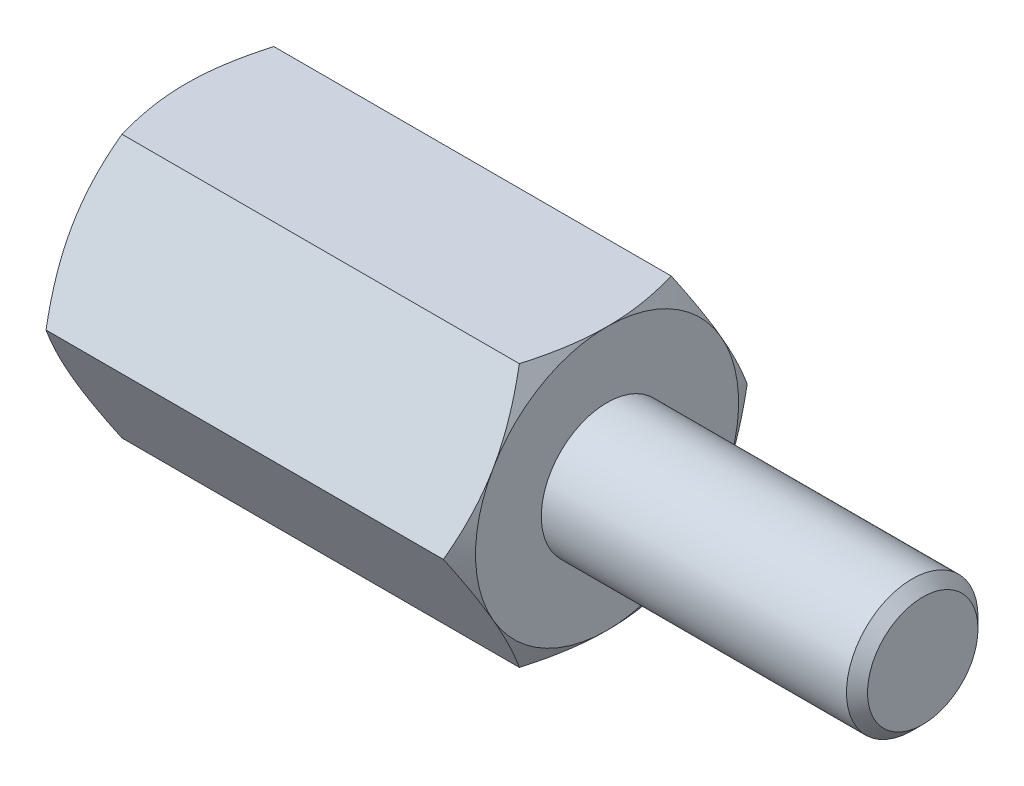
from build123d import *

# Parameters (mm, degrees)
EXTRUDE2_DEPTH = 4
SKETCH3_R      = 1.05
EXTRUDE3_DEPTH = 5
SKETCH5_R      = 1.25
EXTRUDE4_DEPTH = 6
CHAMFER1_SIZE  = 0.2


with BuildPart() as part:
    # Sketch1 → Extrude2 (new, symmetric)
    with BuildSketch(Plane(origin=(0, 0, 0), x_dir=(0, 0, -1), z_dir=(1, 0, 0))):
        Polygon((1.443375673, 2.5), (-1.443375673, 2.5), (-2.886751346, 0), (-1.443375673, -2.5), (1.443375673, -2.5), (2.886751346, 0), align=None)
    extrude(amount=EXTRUDE2_DEPTH, both=True)

    # Sketch2 → Cut-Revolve1 (revolve, cut)
    with BuildSketch(Plane.XY):
        with BuildLine():
            Line((-4, 2.5), (-2.5, 5.098076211))
            ThreePointArc((-2.5, 5.098076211), (-2.98810136, 6.276457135), (-4, 5.5))
            Line((-4, 5.5), (-4, 2.5))
        make_face()
    cut_revolve1 = revolve(axis=Axis((0, 0, 0), (1, 0, 0)), mode=Mode.SUBTRACT)

    # Mirror1: Cut-Revolve1 across plane
    add(cut_revolve1.mirror(Plane(origin=(0, 0, 0), x_dir=(0, 0, 1), z_dir=(1, 0, 0))), mode=Mode.SUBTRACT)

    # Sketch3 → Extrude3 (cut)
    with BuildSketch(Plane.ZY.offset(4)):
        Circle(SKETCH3_R)
    extrude(amount=-EXTRUDE3_DEPTH, mode=Mode.SUBTRACT)

    # Sketch4 → Cut-Revolve2 (revolve, cut)
    with BuildSketch(Plane.XY, mode=Mode.PRIVATE) as cut_revolve2_sk:
        Polygon((1, 0), (1, 1.05), (1.606217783, 0), align=None)
    revolve(cut_revolve2_sk.sketch.rotate(Axis((1.606217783, 0, 0), (-1, 0, 0)), 270), axis=Axis((1.606217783, 0, 0), (-1, 0, 0)), mode=Mode.SUBTRACT)

    # Sketch5 → Extrude4 (add)
    with BuildSketch(Plane(origin=(4, 0, 0), x_dir=(0, 0, -1), z_dir=(1, 0, 0))):
        Circle(SKETCH5_R)
    extrude(amount=EXTRUDE4_DEPTH)

    # Chamfer1
    chamfer1_edges = [part.edges().sort_by_distance(p)[0] for p in [
        (10, 0, 1.25),
    ]]
    chamfer(chamfer1_edges, length=CHAMFER1_SIZE)


solid = part.part
